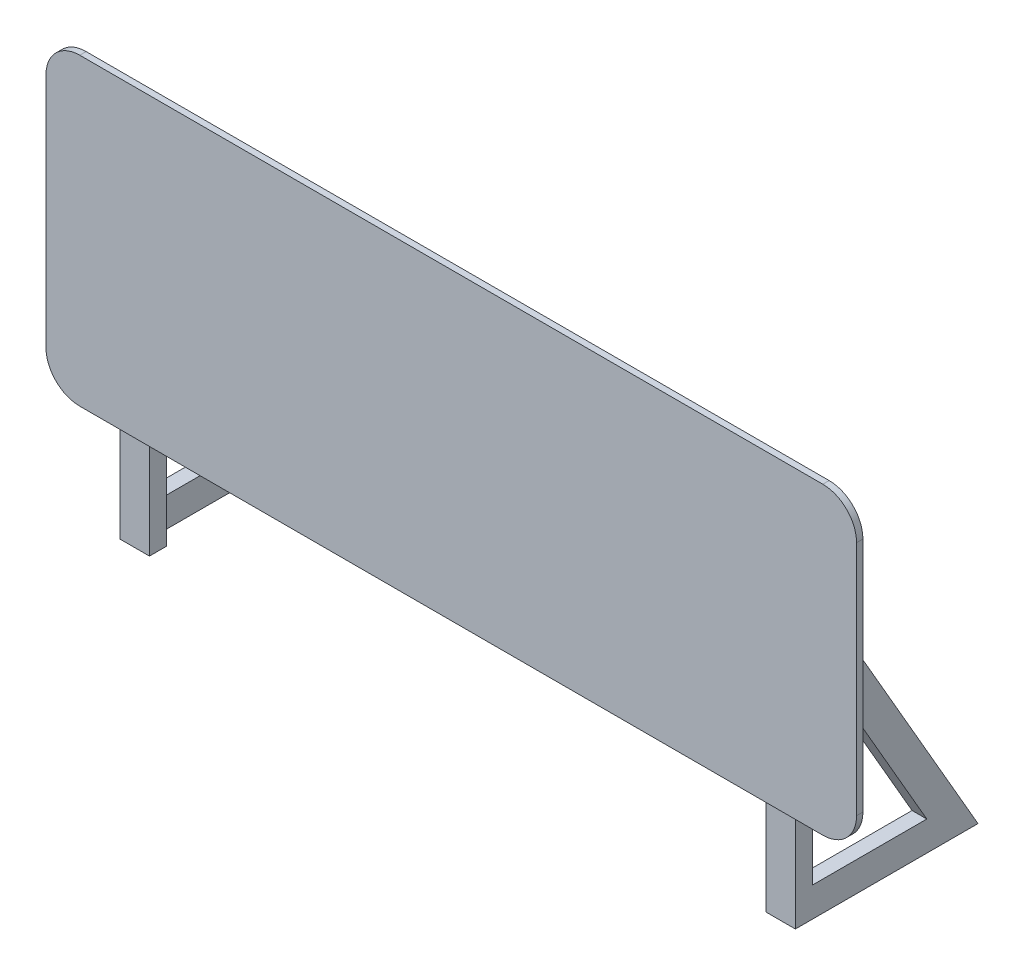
from build123d import *

# Parameters (mm, degrees)
EXTRUDE1_DEPTH = 19.05
SKETCH2_W      = 1854.2
SKETCH2_H      = 431.8
EXTRUDE4_DEPTH = 50.8
EXTRUDE5_DEPTH = 44.45


with BuildPart() as part:
    # Sketch1 → Extrude1 (new body)
    with BuildSketch(Plane.XY):
        with BuildLine():
            Line((-1117.6, 914.4), (1117.6, 914.4))
            ThreePointArc((1117.6, 914.4), (1189.442048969, 884.642048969), (1219.2, 812.8))
            Line((1219.2, 812.8), (1219.2, 101.6))
            ThreePointArc((1219.2, 101.6), (1189.442048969, 29.757951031), (1117.6, 0))
            Line((1117.6, 0), (-1117.6, 0))
            ThreePointArc((-1117.6, 0), (-1189.442048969, 29.757951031), (-1219.2, 101.6))
            Line((-1219.2, 101.6), (-1219.2, 812.8))
            ThreePointArc((-1219.2, 812.8), (-1189.442048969, 884.642048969), (-1117.6, 914.4))
        make_face()
    extrude(amount=EXTRUDE1_DEPTH)


with BuildPart() as body_2:
    # Sketch2 → Extrude4 (new body)
    with BuildSketch(Plane(origin=(0, 0, 0), x_dir=(-1, 0, 0), z_dir=(0, 0, -1))):
        Polygon((-1016, 762), (-927.1, 762), (927.1, 762), (1016, 762), (1016, -304.8), (927.1, -304.8), (927.1, 152.4), (-927.1, 152.4), (-927.1, -304.8), (-1016, -304.8), align=None)
        with Locations((0, 457.2)):
            Rectangle(SKETCH2_W, SKETCH2_H, mode=Mode.SUBTRACT)
    extrude(amount=EXTRUDE4_DEPTH)

    # Sketch4 → Extrude5 (add)
    with BuildSketch(Plane.ZY.offset(1016)):
        Polygon((-50.8, 558.8), (-549.399692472, -304.8), (-50.8, -304.8), (-50.8, -215.9), (-395.420375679, -215.9), (-50.8, 381), align=None)
    extrude5 = extrude(amount=-EXTRUDE5_DEPTH)

    # Mirror3: Extrude5 across plane
    add(extrude5.mirror(Plane(origin=(0, 0, 0), x_dir=(0, 0, 1), z_dir=(1, 0, 0))))


solid = Compound([part.part, body_2.part])
